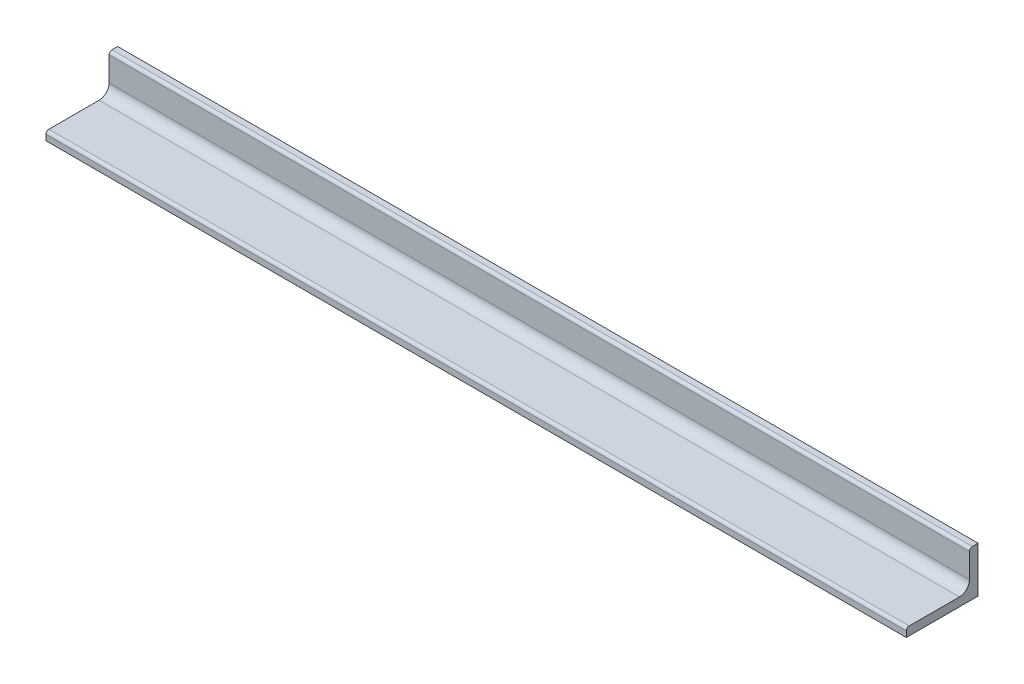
from build123d import *

# Parameters (mm, degrees)
BASE_DEPTH = 300


with BuildPart() as part:
    # Sketch1 → Base (new body)
    with BuildSketch(Plane.YZ):
        with BuildLine():
            Line((0, 25), (0, 0))
            Line((0, 0), (16, 0))
            Line((16, 0), (16, 2))
            ThreePointArc((16, 2), (15.707106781, 2.707106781), (15, 3))
            Line((15, 3), (6.5, 3))
            ThreePointArc((6.5, 3), (4.025126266, 4.025126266), (3, 6.5))
            Line((3, 6.5), (3, 24))
            ThreePointArc((3, 24), (2.707106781, 24.707106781), (2, 25))
            Line((2, 25), (0, 25))
        make_face()
    extrude(amount=BASE_DEPTH)


solid = part.part
